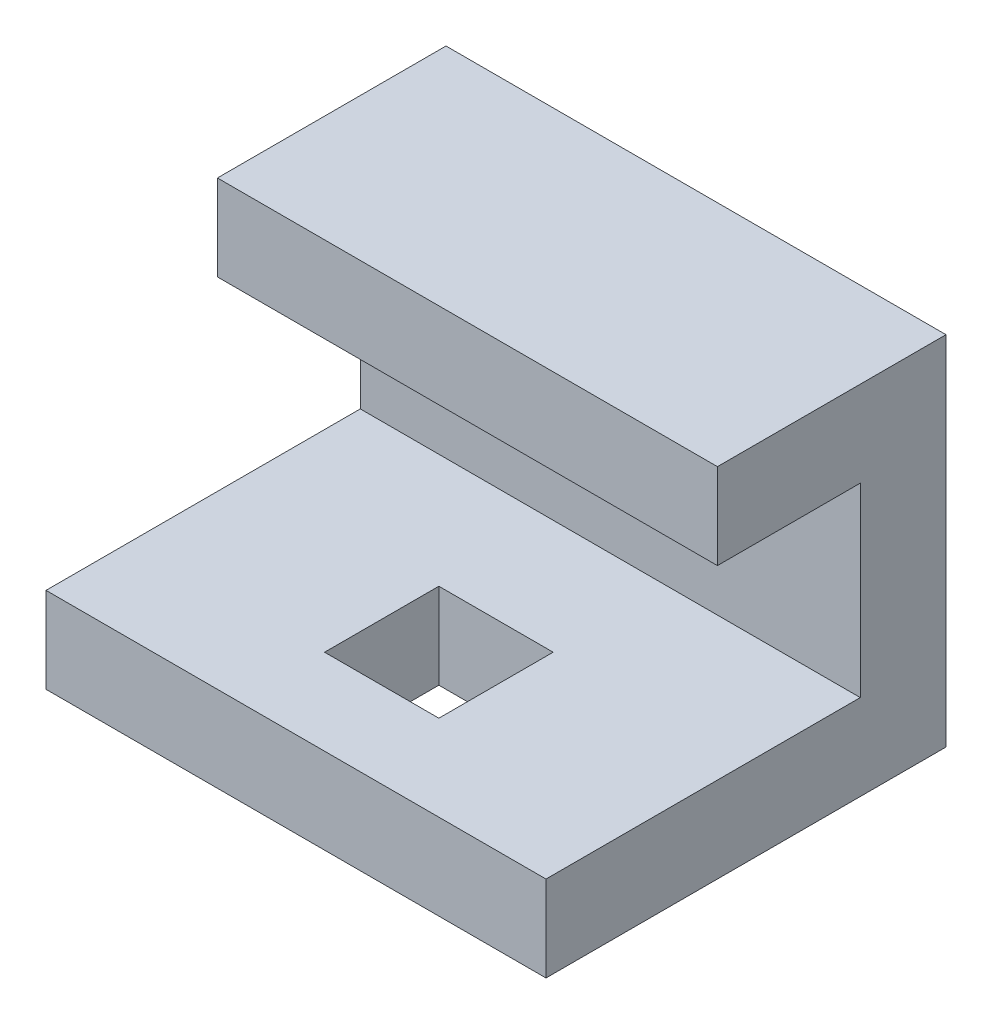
ISO-10303-21;
HEADER;
FILE_DESCRIPTION(('STEP AP214'),'2;1');
FILE_NAME('part.step','',(''),(''),'','','');
FILE_SCHEMA(('AUTOMOTIVE_DESIGN { 1 0 10303 214 1 1 1 1 }'));
ENDSEC;
DATA;
#1=APPLICATION_CONTEXT('core data for automotive mechanical design processes');
#2=APPLICATION_PROTOCOL_DEFINITION('international standard','automotive_design',2000,#1);
#3=PRODUCT_CONTEXT('',#1,'mechanical');
#4=PRODUCT('Part','Part','',(#3));
#5=PRODUCT_RELATED_PRODUCT_CATEGORY('part','',(#4));
#6=PRODUCT_DEFINITION_FORMATION('','',#4);
#7=PRODUCT_DEFINITION_CONTEXT('part definition',#1,'design');
#8=PRODUCT_DEFINITION('design','',#6,#7);
#9=PRODUCT_DEFINITION_SHAPE('','',#8);
#10=(LENGTH_UNIT() NAMED_UNIT(*) SI_UNIT(.MILLI.,.METRE.));
#11=(NAMED_UNIT(*) PLANE_ANGLE_UNIT() SI_UNIT($,.RADIAN.));
#12=(NAMED_UNIT(*) SI_UNIT($,.STERADIAN.) SOLID_ANGLE_UNIT());
#13=UNCERTAINTY_MEASURE_WITH_UNIT(LENGTH_MEASURE(1.E-05),#10,'distance_accuracy_value','');
#14=(GEOMETRIC_REPRESENTATION_CONTEXT(3) GLOBAL_UNCERTAINTY_ASSIGNED_CONTEXT((#13)) GLOBAL_UNIT_ASSIGNED_CONTEXT((#10,
#11,#12)) REPRESENTATION_CONTEXT('',''));
#15=CARTESIAN_POINT('',(0.,0.,0.));
#16=DIRECTION('',(0.,0.,1.));
#17=DIRECTION('',(1.,0.,0.));
#18=AXIS2_PLACEMENT_3D('',#15,#16,#17);
#19=CARTESIAN_POINT('',(0.,-50.,56.));
#20=DIRECTION('',(0.,1.,0.));
#21=DIRECTION('',(0.,0.,1.));
#22=AXIS2_PLACEMENT_3D('',#19,#20,#21);
#23=PLANE('',#22);
#24=DIRECTION('',(1.,0.,0.));
#25=VECTOR('',#24,1.);
#26=CARTESIAN_POINT('',(0.,-50.,0.));
#27=LINE('',#26,#25);
#28=CARTESIAN_POINT('',(0.,-50.,0.));
#29=VERTEX_POINT('',#28);
#30=CARTESIAN_POINT('',(70.,-50.,0.));
#31=VERTEX_POINT('',#30);
#32=EDGE_CURVE('E242',#29,#31,#27,.T.);
#33=ORIENTED_EDGE('',*,*,#32,.T.);
#34=DIRECTION('',(0.,0.,-1.));
#35=VECTOR('',#34,1.);
#36=CARTESIAN_POINT('',(70.,-50.,56.));
#37=LINE('',#36,#35);
#38=CARTESIAN_POINT('',(70.,-50.,56.));
#39=VERTEX_POINT('',#38);
#40=EDGE_CURVE('E53',#39,#31,#37,.T.);
#41=ORIENTED_EDGE('',*,*,#40,.F.);
#42=DIRECTION('',(1.,0.,0.));
#43=VECTOR('',#42,1.);
#44=CARTESIAN_POINT('',(0.,-50.,56.));
#45=LINE('',#44,#43);
#46=CARTESIAN_POINT('',(0.,-50.,56.));
#47=VERTEX_POINT('',#46);
#48=EDGE_CURVE('E230',#47,#39,#45,.T.);
#49=ORIENTED_EDGE('',*,*,#48,.F.);
#50=DIRECTION('',(0.,0.,-1.));
#51=VECTOR('',#50,1.);
#52=CARTESIAN_POINT('',(0.,-50.,56.));
#53=LINE('',#52,#51);
#54=EDGE_CURVE('E11',#47,#29,#53,.T.);
#55=ORIENTED_EDGE('',*,*,#54,.T.);
#56=EDGE_LOOP('',(#33,#41,#49,#55));
#57=FACE_BOUND('',#56,.T.);
#58=DIRECTION('',(0.,0.,1.));
#59=VECTOR('',#58,1.);
#60=CARTESIAN_POINT('',(43.,-50.,56.));
#61=LINE('',#60,#59);
#62=CARTESIAN_POINT('',(43.,-50.,28.));
#63=VERTEX_POINT('',#62);
#64=CARTESIAN_POINT('',(43.,-50.,44.));
#65=VERTEX_POINT('',#64);
#66=EDGE_CURVE('E177',#63,#65,#61,.T.);
#67=ORIENTED_EDGE('',*,*,#66,.F.);
#68=DIRECTION('',(1.,0.,0.));
#69=VECTOR('',#68,1.);
#70=CARTESIAN_POINT('',(0.,-50.,28.));
#71=LINE('',#70,#69);
#72=CARTESIAN_POINT('',(27.,-50.,28.));
#73=VERTEX_POINT('',#72);
#74=EDGE_CURVE('E164',#73,#63,#71,.T.);
#75=ORIENTED_EDGE('',*,*,#74,.F.);
#76=DIRECTION('',(0.,0.,-1.));
#77=VECTOR('',#76,1.);
#78=CARTESIAN_POINT('',(27.,-50.,56.));
#79=LINE('',#78,#77);
#80=CARTESIAN_POINT('',(27.,-50.,44.));
#81=VERTEX_POINT('',#80);
#82=EDGE_CURVE('E140',#81,#73,#79,.T.);
#83=ORIENTED_EDGE('',*,*,#82,.F.);
#84=DIRECTION('',(1.,0.,0.));
#85=VECTOR('',#84,1.);
#86=CARTESIAN_POINT('',(0.,-50.,44.));
#87=LINE('',#86,#85);
#88=EDGE_CURVE('E173',#81,#65,#87,.T.);
#89=ORIENTED_EDGE('',*,*,#88,.T.);
#90=EDGE_LOOP('',(#67,#75,#83,#89));
#91=FACE_BOUND('',#90,.T.);
#92=ADVANCED_FACE('F44',(#57,#91),#23,.F.);
#93=CARTESIAN_POINT('',(70.,-38.,0.));
#94=DIRECTION('',(0.,-1.,0.));
#95=DIRECTION('',(1.,0.,0.));
#96=AXIS2_PLACEMENT_3D('',#93,#94,#95);
#97=PLANE('',#96);
#98=DIRECTION('',(0.,0.,1.));
#99=VECTOR('',#98,1.);
#100=CARTESIAN_POINT('',(0.,-38.,0.));
#101=LINE('',#100,#99);
#102=CARTESIAN_POINT('',(0.,-38.,12.));
#103=VERTEX_POINT('',#102);
#104=CARTESIAN_POINT('',(0.,-38.,56.));
#105=VERTEX_POINT('',#104);
#106=EDGE_CURVE('E200',#103,#105,#101,.T.);
#107=ORIENTED_EDGE('',*,*,#106,.T.);
#108=DIRECTION('',(-1.,0.,0.));
#109=VECTOR('',#108,1.);
#110=CARTESIAN_POINT('',(70.,-38.,56.));
#111=LINE('',#110,#109);
#112=CARTESIAN_POINT('',(70.,-38.,56.));
#113=VERTEX_POINT('',#112);
#114=EDGE_CURVE('E217',#113,#105,#111,.T.);
#115=ORIENTED_EDGE('',*,*,#114,.F.);
#116=DIRECTION('',(0.,0.,1.));
#117=VECTOR('',#116,1.);
#118=CARTESIAN_POINT('',(70.,-38.,0.));
#119=LINE('',#118,#117);
#120=CARTESIAN_POINT('',(70.,-38.,12.));
#121=VERTEX_POINT('',#120);
#122=EDGE_CURVE('E203',#121,#113,#119,.T.);
#123=ORIENTED_EDGE('',*,*,#122,.F.);
#124=DIRECTION('',(-1.,0.,0.));
#125=VECTOR('',#124,1.);
#126=CARTESIAN_POINT('',(70.,-38.,12.));
#127=LINE('',#126,#125);
#128=EDGE_CURVE('E222',#121,#103,#127,.T.);
#129=ORIENTED_EDGE('',*,*,#128,.T.);
#130=EDGE_LOOP('',(#107,#115,#123,#129));
#131=FACE_BOUND('',#130,.T.);
#132=DIRECTION('',(0.,0.,1.));
#133=VECTOR('',#132,1.);
#134=CARTESIAN_POINT('',(43.,-38.,0.));
#135=LINE('',#134,#133);
#136=CARTESIAN_POINT('',(43.,-38.,28.));
#137=VERTEX_POINT('',#136);
#138=CARTESIAN_POINT('',(43.,-38.,44.));
#139=VERTEX_POINT('',#138);
#140=EDGE_CURVE('E68',#137,#139,#135,.T.);
#141=ORIENTED_EDGE('',*,*,#140,.T.);
#142=DIRECTION('',(1.,0.,0.));
#143=VECTOR('',#142,1.);
#144=CARTESIAN_POINT('',(0.,-38.,44.));
#145=LINE('',#144,#143);
#146=CARTESIAN_POINT('',(27.,-38.,44.));
#147=VERTEX_POINT('',#146);
#148=EDGE_CURVE('E154',#147,#139,#145,.T.);
#149=ORIENTED_EDGE('',*,*,#148,.F.);
#150=DIRECTION('',(0.,0.,-1.));
#151=VECTOR('',#150,1.);
#152=CARTESIAN_POINT('',(27.,-38.,0.));
#153=LINE('',#152,#151);
#154=CARTESIAN_POINT('',(27.,-38.,28.));
#155=VERTEX_POINT('',#154);
#156=EDGE_CURVE('E137',#147,#155,#153,.T.);
#157=ORIENTED_EDGE('',*,*,#156,.T.);
#158=DIRECTION('',(1.,0.,0.));
#159=VECTOR('',#158,1.);
#160=CARTESIAN_POINT('',(0.,-38.,28.));
#161=LINE('',#160,#159);
#162=EDGE_CURVE('E147',#155,#137,#161,.T.);
#163=ORIENTED_EDGE('',*,*,#162,.T.);
#164=EDGE_LOOP('',(#141,#149,#157,#163));
#165=FACE_BOUND('',#164,.T.);
#166=ADVANCED_FACE('F152',(#131,#165),#97,.F.);
#167=CARTESIAN_POINT('',(0.,0.,56.));
#168=DIRECTION('',(1.,0.,0.));
#169=DIRECTION('',(0.,1.,0.));
#170=AXIS2_PLACEMENT_3D('',#167,#168,#169);
#171=PLANE('',#170);
#172=DIRECTION('',(0.,0.,1.));
#173=VECTOR('',#172,1.);
#174=CARTESIAN_POINT('',(0.,-12.,0.));
#175=LINE('',#174,#173);
#176=CARTESIAN_POINT('',(0.,-12.,12.));
#177=VERTEX_POINT('',#176);
#178=CARTESIAN_POINT('',(0.,-12.,32.));
#179=VERTEX_POINT('',#178);
#180=EDGE_CURVE('E191',#177,#179,#175,.T.);
#181=ORIENTED_EDGE('',*,*,#180,.T.);
#182=DIRECTION('',(0.,-1.,0.));
#183=VECTOR('',#182,1.);
#184=CARTESIAN_POINT('',(0.,-12.,32.));
#185=LINE('',#184,#183);
#186=CARTESIAN_POINT('',(0.,0.,32.));
#187=VERTEX_POINT('',#186);
#188=EDGE_CURVE('E180',#187,#179,#185,.T.);
#189=ORIENTED_EDGE('',*,*,#188,.F.);
#190=DIRECTION('',(0.,0.,-1.));
#191=VECTOR('',#190,1.);
#192=CARTESIAN_POINT('',(0.,0.,56.));
#193=LINE('',#192,#191);
#194=CARTESIAN_POINT('',(0.,0.,0.));
#195=VERTEX_POINT('',#194);
#196=EDGE_CURVE('E238',#187,#195,#193,.T.);
#197=ORIENTED_EDGE('',*,*,#196,.T.);
#198=DIRECTION('',(0.,-1.,0.));
#199=VECTOR('',#198,1.);
#200=CARTESIAN_POINT('',(0.,0.,0.));
#201=LINE('',#200,#199);
#202=EDGE_CURVE('E221',#195,#29,#201,.T.);
#203=ORIENTED_EDGE('',*,*,#202,.T.);
#204=ORIENTED_EDGE('',*,*,#54,.F.);
#205=DIRECTION('',(0.,-1.,0.));
#206=VECTOR('',#205,1.);
#207=CARTESIAN_POINT('',(0.,0.,56.));
#208=LINE('',#207,#206);
#209=EDGE_CURVE('E227',#105,#47,#208,.T.);
#210=ORIENTED_EDGE('',*,*,#209,.F.);
#211=ORIENTED_EDGE('',*,*,#106,.F.);
#212=DIRECTION('',(0.,1.,0.));
#213=VECTOR('',#212,1.);
#214=CARTESIAN_POINT('',(0.,0.,12.));
#215=LINE('',#214,#213);
#216=EDGE_CURVE('E211',#103,#177,#215,.T.);
#217=ORIENTED_EDGE('',*,*,#216,.T.);
#218=EDGE_LOOP('',(#181,#189,#197,#203,#204,#210,#211,#217));
#219=FACE_BOUND('',#218,.T.);
#220=ADVANCED_FACE('F46',(#219),#171,.F.);
#221=CARTESIAN_POINT('',(70.,0.,56.));
#222=DIRECTION('',(-1.,0.,0.));
#223=DIRECTION('',(0.,0.,1.));
#224=AXIS2_PLACEMENT_3D('',#221,#222,#223);
#225=PLANE('',#224);
#226=DIRECTION('',(0.,0.,-1.));
#227=VECTOR('',#226,1.);
#228=CARTESIAN_POINT('',(70.,0.,56.));
#229=LINE('',#228,#227);
#230=CARTESIAN_POINT('',(70.,0.,32.));
#231=VERTEX_POINT('',#230);
#232=CARTESIAN_POINT('',(70.,0.,0.));
#233=VERTEX_POINT('',#232);
#234=EDGE_CURVE('E254',#231,#233,#229,.T.);
#235=ORIENTED_EDGE('',*,*,#234,.F.);
#236=DIRECTION('',(0.,-1.,0.));
#237=VECTOR('',#236,1.);
#238=CARTESIAN_POINT('',(70.,-12.,32.));
#239=LINE('',#238,#237);
#240=CARTESIAN_POINT('',(70.,-12.,32.));
#241=VERTEX_POINT('',#240);
#242=EDGE_CURVE('E181',#231,#241,#239,.T.);
#243=ORIENTED_EDGE('',*,*,#242,.T.);
#244=DIRECTION('',(0.,0.,1.));
#245=VECTOR('',#244,1.);
#246=CARTESIAN_POINT('',(70.,-12.,0.));
#247=LINE('',#246,#245);
#248=CARTESIAN_POINT('',(70.,-12.,12.));
#249=VERTEX_POINT('',#248);
#250=EDGE_CURVE('E195',#249,#241,#247,.T.);
#251=ORIENTED_EDGE('',*,*,#250,.F.);
#252=DIRECTION('',(0.,1.,0.));
#253=VECTOR('',#252,1.);
#254=CARTESIAN_POINT('',(70.,0.,12.));
#255=LINE('',#254,#253);
#256=EDGE_CURVE('E199',#121,#249,#255,.T.);
#257=ORIENTED_EDGE('',*,*,#256,.F.);
#258=ORIENTED_EDGE('',*,*,#122,.T.);
#259=DIRECTION('',(0.,1.,0.));
#260=VECTOR('',#259,1.);
#261=CARTESIAN_POINT('',(70.,0.,56.));
#262=LINE('',#261,#260);
#263=EDGE_CURVE('E234',#39,#113,#262,.T.);
#264=ORIENTED_EDGE('',*,*,#263,.F.);
#265=ORIENTED_EDGE('',*,*,#40,.T.);
#266=DIRECTION('',(0.,1.,0.));
#267=VECTOR('',#266,1.);
#268=CARTESIAN_POINT('',(70.,0.,0.));
#269=LINE('',#268,#267);
#270=EDGE_CURVE('E245',#31,#233,#269,.T.);
#271=ORIENTED_EDGE('',*,*,#270,.T.);
#272=EDGE_LOOP('',(#235,#243,#251,#257,#258,#264,#265,#271));
#273=FACE_BOUND('',#272,.T.);
#274=ADVANCED_FACE('F263',(#273),#225,.F.);
#275=CARTESIAN_POINT('',(0.,0.,56.));
#276=DIRECTION('',(0.,-1.,0.));
#277=DIRECTION('',(0.,0.,-1.));
#278=AXIS2_PLACEMENT_3D('',#275,#276,#277);
#279=PLANE('',#278);
#280=ORIENTED_EDGE('',*,*,#196,.F.);
#281=DIRECTION('',(-1.,0.,0.));
#282=VECTOR('',#281,1.);
#283=CARTESIAN_POINT('',(70.,0.,32.));
#284=LINE('',#283,#282);
#285=EDGE_CURVE('E188',#231,#187,#284,.T.);
#286=ORIENTED_EDGE('',*,*,#285,.F.);
#287=ORIENTED_EDGE('',*,*,#234,.T.);
#288=DIRECTION('',(-1.,0.,0.));
#289=VECTOR('',#288,1.);
#290=CARTESIAN_POINT('',(0.,0.,0.));
#291=LINE('',#290,#289);
#292=EDGE_CURVE('E231',#233,#195,#291,.T.);
#293=ORIENTED_EDGE('',*,*,#292,.T.);
#294=EDGE_LOOP('',(#280,#286,#287,#293));
#295=FACE_BOUND('',#294,.T.);
#296=ADVANCED_FACE('F272',(#295),#279,.F.);
#297=CARTESIAN_POINT('',(0.,0.,56.));
#298=DIRECTION('',(0.,0.,1.));
#299=DIRECTION('',(1.,0.,0.));
#300=AXIS2_PLACEMENT_3D('',#297,#298,#299);
#301=PLANE('',#300);
#302=ORIENTED_EDGE('',*,*,#114,.T.);
#303=ORIENTED_EDGE('',*,*,#209,.T.);
#304=ORIENTED_EDGE('',*,*,#48,.T.);
#305=ORIENTED_EDGE('',*,*,#263,.T.);
#306=EDGE_LOOP('',(#302,#303,#304,#305));
#307=FACE_BOUND('',#306,.T.);
#308=ADVANCED_FACE('F288',(#307),#301,.T.);
#309=CARTESIAN_POINT('',(0.,0.,0.));
#310=DIRECTION('',(0.,0.,1.));
#311=DIRECTION('',(1.,0.,0.));
#312=AXIS2_PLACEMENT_3D('',#309,#310,#311);
#313=PLANE('',#312);
#314=ORIENTED_EDGE('',*,*,#202,.F.);
#315=ORIENTED_EDGE('',*,*,#292,.F.);
#316=ORIENTED_EDGE('',*,*,#270,.F.);
#317=ORIENTED_EDGE('',*,*,#32,.F.);
#318=EDGE_LOOP('',(#314,#315,#316,#317));
#319=FACE_BOUND('',#318,.T.);
#320=ADVANCED_FACE('F269',(#319),#313,.F.);
#321=CARTESIAN_POINT('',(70.,-12.,0.));
#322=DIRECTION('',(0.,-1.,0.));
#323=DIRECTION('',(1.,0.,0.));
#324=AXIS2_PLACEMENT_3D('',#321,#322,#323);
#325=PLANE('',#324);
#326=DIRECTION('',(-1.,0.,0.));
#327=VECTOR('',#326,1.);
#328=CARTESIAN_POINT('',(70.,-12.,32.));
#329=LINE('',#328,#327);
#330=EDGE_CURVE('E185',#241,#179,#329,.T.);
#331=ORIENTED_EDGE('',*,*,#330,.T.);
#332=ORIENTED_EDGE('',*,*,#180,.F.);
#333=DIRECTION('',(-1.,0.,0.));
#334=VECTOR('',#333,1.);
#335=CARTESIAN_POINT('',(70.,-12.,12.));
#336=LINE('',#335,#334);
#337=EDGE_CURVE('E207',#249,#177,#336,.T.);
#338=ORIENTED_EDGE('',*,*,#337,.F.);
#339=ORIENTED_EDGE('',*,*,#250,.T.);
#340=EDGE_LOOP('',(#331,#332,#338,#339));
#341=FACE_BOUND('',#340,.T.);
#342=ADVANCED_FACE('F279',(#341),#325,.T.);
#343=CARTESIAN_POINT('',(70.,0.,12.));
#344=DIRECTION('',(0.,0.,1.));
#345=DIRECTION('',(1.,0.,0.));
#346=AXIS2_PLACEMENT_3D('',#343,#344,#345);
#347=PLANE('',#346);
#348=ORIENTED_EDGE('',*,*,#216,.F.);
#349=ORIENTED_EDGE('',*,*,#128,.F.);
#350=ORIENTED_EDGE('',*,*,#256,.T.);
#351=ORIENTED_EDGE('',*,*,#337,.T.);
#352=EDGE_LOOP('',(#348,#349,#350,#351));
#353=FACE_BOUND('',#352,.T.);
#354=ADVANCED_FACE('F283',(#353),#347,.T.);
#355=CARTESIAN_POINT('',(70.,-12.,32.));
#356=DIRECTION('',(0.,0.,-1.));
#357=DIRECTION('',(-1.,0.,0.));
#358=AXIS2_PLACEMENT_3D('',#355,#356,#357);
#359=PLANE('',#358);
#360=ORIENTED_EDGE('',*,*,#188,.T.);
#361=ORIENTED_EDGE('',*,*,#330,.F.);
#362=ORIENTED_EDGE('',*,*,#242,.F.);
#363=ORIENTED_EDGE('',*,*,#285,.T.);
#364=EDGE_LOOP('',(#360,#361,#362,#363));
#365=FACE_BOUND('',#364,.T.);
#366=ADVANCED_FACE('F294',(#365),#359,.F.);
#367=CARTESIAN_POINT('',(43.,-108.,0.));
#368=DIRECTION('',(-1.,0.,0.));
#369=DIRECTION('',(0.,-1.,0.));
#370=AXIS2_PLACEMENT_3D('',#367,#368,#369);
#371=PLANE('',#370);
#372=ORIENTED_EDGE('',*,*,#66,.T.);
#373=DIRECTION('',(0.,1.,0.));
#374=VECTOR('',#373,1.);
#375=CARTESIAN_POINT('',(43.,-108.,44.));
#376=LINE('',#375,#374);
#377=EDGE_CURVE('E161',#65,#139,#376,.T.);
#378=ORIENTED_EDGE('',*,*,#377,.T.);
#379=ORIENTED_EDGE('',*,*,#140,.F.);
#380=DIRECTION('',(0.,1.,0.));
#381=VECTOR('',#380,1.);
#382=CARTESIAN_POINT('',(43.,-108.,28.));
#383=LINE('',#382,#381);
#384=EDGE_CURVE('E144',#63,#137,#383,.T.);
#385=ORIENTED_EDGE('',*,*,#384,.F.);
#386=EDGE_LOOP('',(#372,#378,#379,#385));
#387=FACE_BOUND('',#386,.T.);
#388=ADVANCED_FACE('F296',(#387),#371,.T.);
#389=CARTESIAN_POINT('',(0.,-108.,44.));
#390=DIRECTION('',(0.,0.,1.));
#391=DIRECTION('',(1.,0.,0.));
#392=AXIS2_PLACEMENT_3D('',#389,#390,#391);
#393=PLANE('',#392);
#394=DIRECTION('',(0.,1.,0.));
#395=VECTOR('',#394,1.);
#396=CARTESIAN_POINT('',(27.,-108.,44.));
#397=LINE('',#396,#395);
#398=EDGE_CURVE('E143',#81,#147,#397,.T.);
#399=ORIENTED_EDGE('',*,*,#398,.T.);
#400=ORIENTED_EDGE('',*,*,#148,.T.);
#401=ORIENTED_EDGE('',*,*,#377,.F.);
#402=ORIENTED_EDGE('',*,*,#88,.F.);
#403=EDGE_LOOP('',(#399,#400,#401,#402));
#404=FACE_BOUND('',#403,.T.);
#405=ADVANCED_FACE('F302',(#404),#393,.F.);
#406=CARTESIAN_POINT('',(27.,-108.,0.));
#407=DIRECTION('',(1.,0.,0.));
#408=DIRECTION('',(0.,1.,0.));
#409=AXIS2_PLACEMENT_3D('',#406,#407,#408);
#410=PLANE('',#409);
#411=ORIENTED_EDGE('',*,*,#82,.T.);
#412=DIRECTION('',(0.,1.,0.));
#413=VECTOR('',#412,1.);
#414=CARTESIAN_POINT('',(27.,-108.,28.));
#415=LINE('',#414,#413);
#416=EDGE_CURVE('E60',#73,#155,#415,.T.);
#417=ORIENTED_EDGE('',*,*,#416,.T.);
#418=ORIENTED_EDGE('',*,*,#156,.F.);
#419=ORIENTED_EDGE('',*,*,#398,.F.);
#420=EDGE_LOOP('',(#411,#417,#418,#419));
#421=FACE_BOUND('',#420,.T.);
#422=ADVANCED_FACE('F134',(#421),#410,.T.);
#423=CARTESIAN_POINT('',(0.,-108.,28.));
#424=DIRECTION('',(0.,0.,1.));
#425=DIRECTION('',(1.,0.,0.));
#426=AXIS2_PLACEMENT_3D('',#423,#424,#425);
#427=PLANE('',#426);
#428=ORIENTED_EDGE('',*,*,#74,.T.);
#429=ORIENTED_EDGE('',*,*,#384,.T.);
#430=ORIENTED_EDGE('',*,*,#162,.F.);
#431=ORIENTED_EDGE('',*,*,#416,.F.);
#432=EDGE_LOOP('',(#428,#429,#430,#431));
#433=FACE_BOUND('',#432,.T.);
#434=ADVANCED_FACE('F148',(#433),#427,.T.);
#435=CLOSED_SHELL('',(#92,#166,#220,#274,#296,#308,#320,#342,#354,#366,#388,#405,#422,#434));
#436=MANIFOLD_SOLID_BREP('B2',#435);
#437=ADVANCED_BREP_SHAPE_REPRESENTATION('',(#18,#436),#14);
#438=SHAPE_DEFINITION_REPRESENTATION(#9,#437);
ENDSEC;
END-ISO-10303-21;
